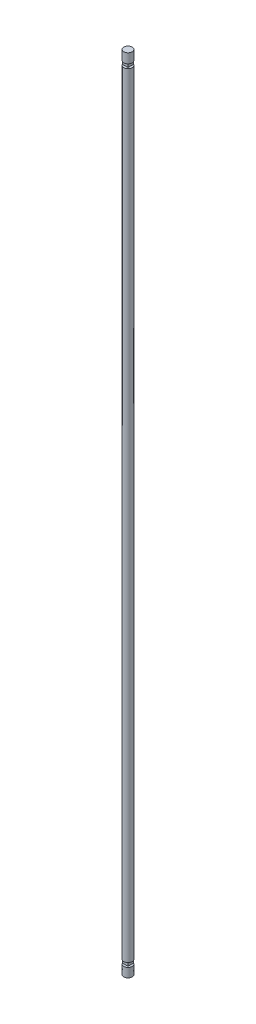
from build123d import *

# Parameters (mm, degrees)
SKETCH1_R          = 4.7625
EXTRUDE1_DEPTH     = 914.4
SKETCH2_W          = 22.7907933
SKETCH2_H          = 4.7625
SKETCH2_W_2        = 36.150727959
CUT_EXTRUDE1_DEPTH = 2.54
SKETCH3_W          = 28.338153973
SKETCH3_H          = 4.7625
SKETCH3_W_2        = 22.166360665
CUT_EXTRUDE2_DEPTH = 2.54


with BuildPart() as part:
    # Sketch1 → Extrude1 (new body)
    with BuildSketch(Plane(origin=(0, 0, 0), x_dir=(1, 0, 0), z_dir=(0, 1, 0))):
        with Locations(Location((0, 0, 0), (0, 0, 270))):
            Circle(SKETCH1_R)
    extrude(amount=EXTRUDE1_DEPTH)

    # Sketch2 → Cut-Extrude1 (cut)
    with BuildSketch(Plane.XY.offset(4.7625)):
        with Locations((1.424188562, 12.79525)):
            Rectangle(SKETCH2_W, SKETCH2_H)
        with Locations((4.633522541, 901.09675)):
            Rectangle(SKETCH2_W_2, SKETCH2_H)
    extrude(amount=-CUT_EXTRUDE1_DEPTH, mode=Mode.SUBTRACT)

    # Sketch3 → Cut-Extrude2 (cut)
    with BuildSketch(Plane(origin=(4.7625, 0, 0), x_dir=(0, 0, -1), z_dir=(1, 0, 0))):
        with Locations((2.12869475, 901.09675)):
            Rectangle(SKETCH3_W, SKETCH3_H)
        with Locations((3.053662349, 12.79525)):
            Rectangle(SKETCH3_W_2, SKETCH3_H)
    extrude(amount=-CUT_EXTRUDE2_DEPTH, mode=Mode.SUBTRACT)


solid = part.part
